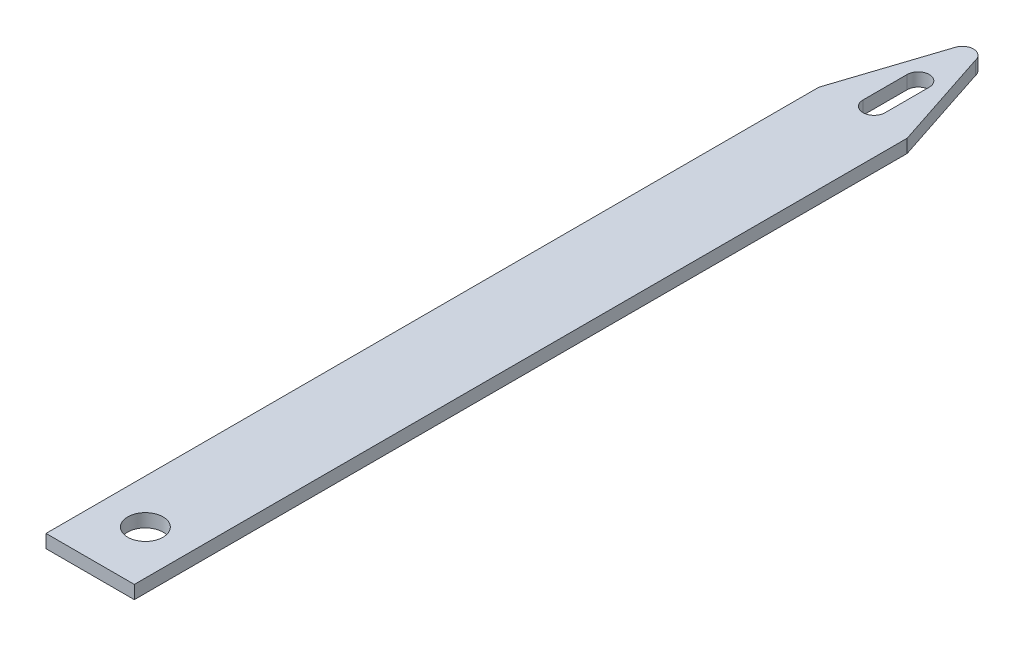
from build123d import *

# Parameters (mm, degrees)
EXTRUDE1_DEPTH      = 20
EXTRUDE1_DEPTH_BACK = 20
SKETCH1_W           = 4
SKETCH1_H           = 0.6
SKETCH2_R           = 0.8
CUT_EXTRUDE1_DEPTH  = 21.404901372


with BuildPart() as part:
    # Sketch1 → Extrude1 (new, two sides: drawn at the far end of the back side and taken through both)
    with BuildSketch(Plane.XY.offset(-EXTRUDE1_DEPTH_BACK)):
        with Locations((2, 0.3)):
            Rectangle(SKETCH1_W, SKETCH1_H)
    extrude(amount=EXTRUDE1_DEPTH + EXTRUDE1_DEPTH_BACK)

    # Sketch2 → Cut-Extrude1 (cut, through all)
    with BuildSketch(Plane(origin=(0, 0.6, 0), x_dir=(1, 0, 0), z_dir=(0, 1, 0))):
        with BuildLine():
            Line((1.5, 17.5), (1.5, 15.5))
            ThreePointArc((1.5, 15.5), (2, 15), (2.5, 15.5))
            Line((2.5, 15.5), (2.5, 17.5))
            ThreePointArc((2.5, 17.5), (2, 18), (1.5, 17.5))
        make_face()
        with BuildLine():
            Line((0, 20), (0, 15))
            Line((0, 15), (1.524836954, 19.655628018))
            ThreePointArc((1.524836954, 19.655628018), (1.706583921, 19.9048543), (2, 20))
            Line((2, 20), (0, 20))
        make_face()
        with BuildLine():
            Line((2.490312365, 19.59794787), (4, 15))
            Line((4, 15), (4, 20))
            Line((4, 20), (2, 20))
            ThreePointArc((2, 20), (2.317037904, 19.886635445), (2.490312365, 19.59794787))
        make_face()
        with Locations(Location((2, -17.5, 0), (0, 0, 90))):
            Circle(SKETCH2_R)
    extrude(amount=-CUT_EXTRUDE1_DEPTH, mode=Mode.SUBTRACT)


solid = part.part
